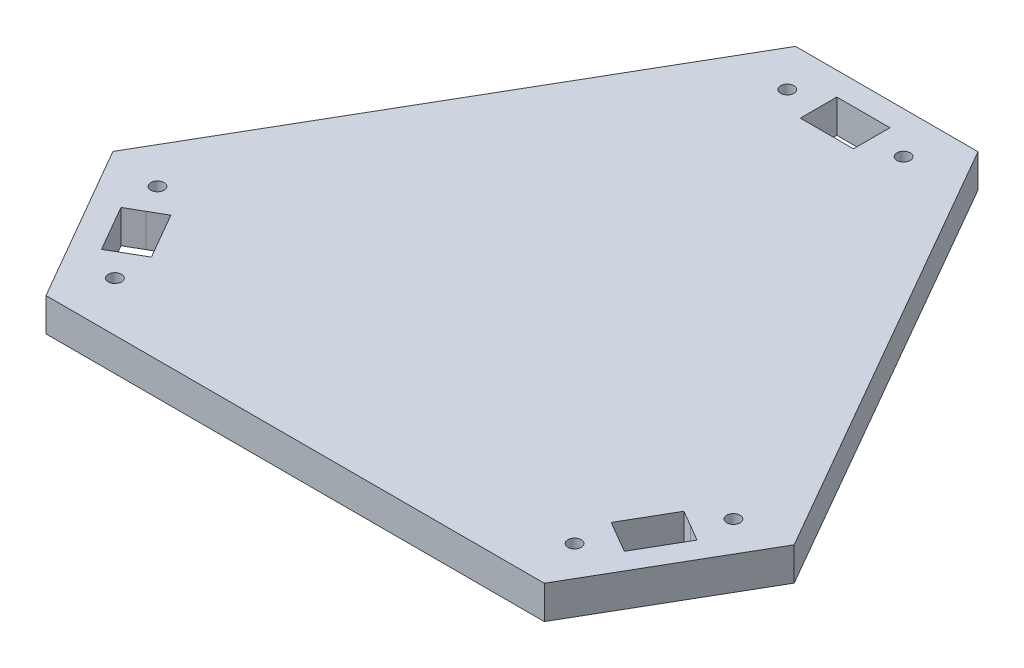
from build123d import *

# Parameters (mm, degrees)
AUFSATZ_LINEAR_AUSTRAGEN1_DEPTH  = 20
SCHNITT_LINEAR_AUSTRAGEN7_DEPTH  = 20
SCHNITT_LINEAR_AUSTRAGEN8_DEPTH  = 20
SCHNITT_LINEAR_AUSTRAGEN9_DEPTH  = 20
SKIZZE2_R                        = 4
SCHNITT_LINEAR_AUSTRAGEN10_DEPTH = 10
SKIZZE4_R                        = 4
SCHNITT_LINEAR_AUSTRAGEN11_DEPTH = 10
SKIZZE5_R                        = 4
SCHNITT_LINEAR_AUSTRAGEN12_DEPTH = 10


with BuildPart() as part:
    # Skizze1 → Aufsatz-Linear austragen1 (new body)
    with BuildSketch(Plane(origin=(0, 0, 0), x_dir=(1, 0, 0), z_dir=(0, 1, 0))):
        Polygon((-149.988554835, 0), (150.075497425, 0), (205.218263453, 95.301404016), (55.58434216, 355.613027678), (-54.237176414, 355.613027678), (-204.994277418, 95.301404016), align=None)
    extrude(amount=AUFSATZ_LINEAR_AUSTRAGEN1_DEPTH)

    # Skizze7 → Schnitt-Linear austragen7 (cut)
    with BuildSketch(Plane(origin=(0, 20, 0), x_dir=(1, 0, 0), z_dir=(0, 1, 0))):
        Polygon((-163.846416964, 74.021047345), (-173.373413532, 68.522289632), (-157.377027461, 40.807390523), (-147.831885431, 46.274709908), (-138.304888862, 51.77346762), (-154.301274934, 79.48836673), align=None)
    extrude(amount=-SCHNITT_LINEAR_AUSTRAGEN7_DEPTH, mode=Mode.SUBTRACT)

    # Skizze8 → Schnitt-Linear austragen8 (cut)
    with BuildSketch(Plane(origin=(0, 20, 0), x_dir=(1, 0, 0), z_dir=(0, 1, 0))):
        Polygon((164.047486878, 74.065416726), (154.526423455, 79.574441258), (138.50017027, 51.876802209), (147.968712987, 46.277007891), (157.489776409, 40.767983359), (173.516029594, 68.465622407), align=None)
    extrude(amount=-SCHNITT_LINEAR_AUSTRAGEN8_DEPTH, mode=Mode.SUBTRACT)

    # Skizze11 → Schnitt-Linear austragen9 (cut)
    with BuildSketch(Plane(origin=(0, 20, 0), x_dir=(1, 0, 0), z_dir=(0, 1, 0))):
        Polygon((-15.41565784, 330.613027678), (-15.41565784, 319.613027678), (16.58434216, 319.613027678), (16.58434216, 341.613027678), (-15.41565784, 341.613027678), align=None)
    extrude(amount=-SCHNITT_LINEAR_AUSTRAGEN9_DEPTH, mode=Mode.SUBTRACT)

    # Skizze2 → Schnitt-Linear austragen10 (cut)
    with BuildSketch(Plane(origin=(0, 20, 0), x_dir=(1, 0, 0), z_dir=(0, 1, 0))):
        with Locations(Location((173.510553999, 90.420120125, 0), (0, 0, 270))):
            Circle(SKIZZE2_R)
        with Locations(Location((138.453125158, 29.831534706, 0), (0, 0, 270))):
            Circle(SKIZZE2_R)
    extrude(amount=-SCHNITT_LINEAR_AUSTRAGEN10_DEPTH, mode=Mode.SUBTRACT)

    # Skizze4 → Schnitt-Linear austragen11 (cut)
    with BuildSketch(Plane(origin=(0, 20, 0), x_dir=(1, 0, 0), z_dir=(0, 1, 0))):
        with Locations(Location((-34.237176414, 330.613027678, 0), (0, 0, 270))):
            Circle(SKIZZE4_R)
        with Locations(Location((35.762823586, 330.613027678, 0), (0, 0, 270))):
            Circle(SKIZZE4_R)
    extrude(amount=-SCHNITT_LINEAR_AUSTRAGEN11_DEPTH, mode=Mode.SUBTRACT)

    # Skizze5 → Schnitt-Linear austragen12 (cut)
    with BuildSketch(Plane(origin=(0, 20, 0), x_dir=(1, 0, 0), z_dir=(0, 1, 0))):
        with Locations(Location((-173.344271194, 90.476768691, 0), (0, 0, 270))):
            Circle(SKIZZE5_R)
        with Locations(Location((-138.352176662, 29.850426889, 0), (0, 0, 270))):
            Circle(SKIZZE5_R)
    extrude(amount=-SCHNITT_LINEAR_AUSTRAGEN12_DEPTH, mode=Mode.SUBTRACT)


solid = part.part
